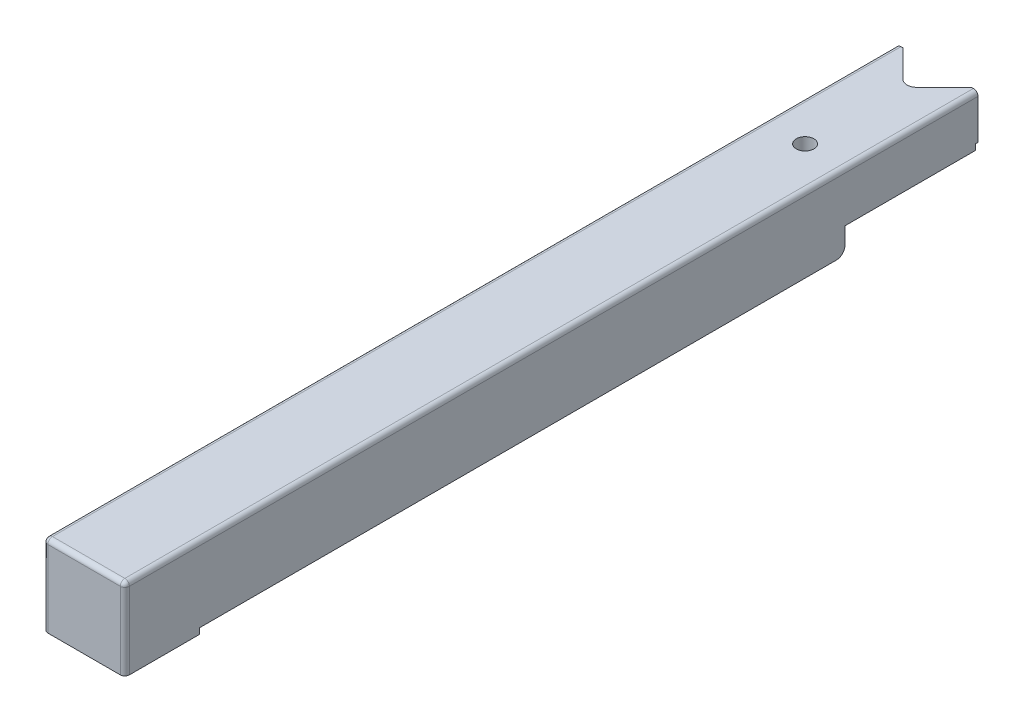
ISO-10303-21;
HEADER;
FILE_DESCRIPTION(('STEP AP214'),'2;1');
FILE_NAME('part.step','',(''),(''),'','','');
FILE_SCHEMA(('AUTOMOTIVE_DESIGN { 1 0 10303 214 1 1 1 1 }'));
ENDSEC;
DATA;
#1=APPLICATION_CONTEXT('core data for automotive mechanical design processes');
#2=APPLICATION_PROTOCOL_DEFINITION('international standard','automotive_design',2000,#1);
#3=PRODUCT_CONTEXT('',#1,'mechanical');
#4=PRODUCT('Part','Part','',(#3));
#5=PRODUCT_RELATED_PRODUCT_CATEGORY('part','',(#4));
#6=PRODUCT_DEFINITION_FORMATION('','',#4);
#7=PRODUCT_DEFINITION_CONTEXT('part definition',#1,'design');
#8=PRODUCT_DEFINITION('design','',#6,#7);
#9=PRODUCT_DEFINITION_SHAPE('','',#8);
#10=(LENGTH_UNIT() NAMED_UNIT(*) SI_UNIT(.MILLI.,.METRE.));
#11=(NAMED_UNIT(*) PLANE_ANGLE_UNIT() SI_UNIT($,.RADIAN.));
#12=(NAMED_UNIT(*) SI_UNIT($,.STERADIAN.) SOLID_ANGLE_UNIT());
#13=UNCERTAINTY_MEASURE_WITH_UNIT(LENGTH_MEASURE(1.E-05),#10,'distance_accuracy_value','');
#14=(GEOMETRIC_REPRESENTATION_CONTEXT(3) GLOBAL_UNCERTAINTY_ASSIGNED_CONTEXT((#13)) GLOBAL_UNIT_ASSIGNED_CONTEXT((#10,
#11,#12)) REPRESENTATION_CONTEXT('',''));
#15=CARTESIAN_POINT('',(0.,0.,0.));
#16=DIRECTION('',(0.,0.,1.));
#17=DIRECTION('',(1.,0.,0.));
#18=AXIS2_PLACEMENT_3D('',#15,#16,#17);
#19=CARTESIAN_POINT('',(22.606,-27.813,-471.678));
#20=DIRECTION('',(0.,1.,0.));
#21=DIRECTION('',(0.,0.,1.));
#22=AXIS2_PLACEMENT_3D('',#19,#20,#21);
#23=PLANE('',#22);
#24=CARTESIAN_POINT('',(0.,-27.813,-399.796));
#25=DIRECTION('',(0.,-1.,0.));
#26=DIRECTION('',(0.,0.,-1.));
#27=AXIS2_PLACEMENT_3D('',#24,#25,#26);
#28=CIRCLE('',#27,4.88949999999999);
#29=CARTESIAN_POINT('',(0.,-27.813,-404.6855));
#30=VERTEX_POINT('',#29);
#31=EDGE_CURVE('E369',#30,#30,#28,.T.);
#32=ORIENTED_EDGE('',*,*,#31,.F.);
#33=EDGE_LOOP('',(#32));
#34=FACE_BOUND('',#33,.T.);
#35=DIRECTION('',(0.707106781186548,0.,-0.707106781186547));
#36=VECTOR('',#35,1.);
#37=CARTESIAN_POINT('',(20.5739999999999,-27.813,-471.678));
#38=LINE('',#37,#36);
#39=CARTESIAN_POINT('',(3.95131269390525,-27.813,-455.055312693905));
#40=VERTEX_POINT('',#39);
#41=CARTESIAN_POINT('',(20.5739999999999,-27.813,-471.678));
#42=VERTEX_POINT('',#41);
#43=EDGE_CURVE('E318',#40,#42,#38,.T.);
#44=ORIENTED_EDGE('',*,*,#43,.T.);
#45=DIRECTION('',(-1.,0.,0.));
#46=VECTOR('',#45,1.);
#47=CARTESIAN_POINT('',(22.606,-27.813,-471.678));
#48=LINE('',#47,#46);
#49=CARTESIAN_POINT('',(22.606,-27.813,-471.678));
#50=VERTEX_POINT('',#49);
#51=EDGE_CURVE('E505',#50,#42,#48,.T.);
#52=ORIENTED_EDGE('',*,*,#51,.F.);
#53=DIRECTION('',(0.,0.,-1.));
#54=VECTOR('',#53,1.);
#55=CARTESIAN_POINT('',(22.606,-27.813,-471.678));
#56=LINE('',#55,#54);
#57=CARTESIAN_POINT('',(22.606,-27.813,-399.31338176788));
#58=VERTEX_POINT('',#57);
#59=EDGE_CURVE('E441',#58,#50,#56,.T.);
#60=ORIENTED_EDGE('',*,*,#59,.F.);
#61=DIRECTION('',(-1.,0.,0.));
#62=VECTOR('',#61,1.);
#63=CARTESIAN_POINT('',(22.606,-27.813,-399.31338176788));
#64=LINE('',#63,#62);
#65=CARTESIAN_POINT('',(17.8308,-27.813,-399.31338176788));
#66=VERTEX_POINT('',#65);
#67=EDGE_CURVE('E509',#58,#66,#64,.T.);
#68=ORIENTED_EDGE('',*,*,#67,.T.);
#69=DIRECTION('',(1.,0.,0.));
#70=VECTOR('',#69,1.);
#71=CARTESIAN_POINT('',(-22.606,-27.813,-399.31338176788));
#72=LINE('',#71,#70);
#73=CARTESIAN_POINT('',(8.05004595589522,-27.813,-399.31338176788));
#74=VERTEX_POINT('',#73);
#75=EDGE_CURVE('E385',#74,#66,#72,.T.);
#76=ORIENTED_EDGE('',*,*,#75,.F.);
#77=CARTESIAN_POINT('',(0.,-27.813,-399.796));
#78=DIRECTION('',(0.,1.,0.));
#79=DIRECTION('',(0.,0.,1.));
#80=AXIS2_PLACEMENT_3D('',#77,#78,#79);
#81=CIRCLE('',#80,8.06449999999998);
#82=CARTESIAN_POINT('',(-8.05004595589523,-27.813,-399.31338176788));
#83=VERTEX_POINT('',#82);
#84=EDGE_CURVE('E374',#74,#83,#81,.F.);
#85=ORIENTED_EDGE('',*,*,#84,.T.);
#86=CARTESIAN_POINT('',(-17.8308,-27.813,-399.31338176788));
#87=VERTEX_POINT('',#86);
#88=EDGE_CURVE('E389',#87,#83,#72,.T.);
#89=ORIENTED_EDGE('',*,*,#88,.F.);
#90=CARTESIAN_POINT('',(-22.606,-27.813,-399.31338176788));
#91=VERTEX_POINT('',#90);
#92=EDGE_CURVE('E508',#87,#91,#64,.T.);
#93=ORIENTED_EDGE('',*,*,#92,.T.);
#94=DIRECTION('',(0.,0.,-1.));
#95=VECTOR('',#94,1.);
#96=CARTESIAN_POINT('',(-22.606,-27.813,-471.678));
#97=LINE('',#96,#95);
#98=CARTESIAN_POINT('',(-22.606,-27.813,-471.678));
#99=VERTEX_POINT('',#98);
#100=EDGE_CURVE('E462',#91,#99,#97,.T.);
#101=ORIENTED_EDGE('',*,*,#100,.T.);
#102=CARTESIAN_POINT('',(-20.5739999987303,-27.813,-471.678));
#103=VERTEX_POINT('',#102);
#104=EDGE_CURVE('E504',#103,#99,#48,.T.);
#105=ORIENTED_EDGE('',*,*,#104,.F.);
#106=DIRECTION('',(0.707106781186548,0.,0.707106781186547));
#107=VECTOR('',#106,1.);
#108=CARTESIAN_POINT('',(-3.9513126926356,-27.813,-455.055312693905));
#109=LINE('',#108,#107);
#110=CARTESIAN_POINT('',(-3.9513126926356,-27.813,-455.055312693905));
#111=VERTEX_POINT('',#110);
#112=EDGE_CURVE('E56',#103,#111,#109,.T.);
#113=ORIENTED_EDGE('',*,*,#112,.T.);
#114=CARTESIAN_POINT('',(6.34825525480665E-10,-27.813,-459.006625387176));
#115=DIRECTION('',(0.,1.,0.));
#116=DIRECTION('',(0.,0.,1.));
#117=AXIS2_PLACEMENT_3D('',#114,#115,#116);
#118=CIRCLE('',#117,5.588);
#119=EDGE_CURVE('E51',#111,#40,#118,.T.);
#120=ORIENTED_EDGE('',*,*,#119,.T.);
#121=EDGE_LOOP('',(#44,#52,#60,#68,#76,#85,#89,#93,#101,#105,#113,#120));
#122=FACE_BOUND('',#121,.T.);
#123=ADVANCED_FACE('F34',(#34,#122),#23,.F.);
#124=CARTESIAN_POINT('',(22.606,-27.813,-471.678));
#125=DIRECTION('',(0.,0.,1.));
#126=DIRECTION('',(1.,0.,0.));
#127=AXIS2_PLACEMENT_3D('',#124,#125,#126);
#128=PLANE('',#127);
#129=DIRECTION('',(0.,1.,0.));
#130=VECTOR('',#129,1.);
#131=CARTESIAN_POINT('',(-20.5739999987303,-628.875110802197,-471.678));
#132=LINE('',#131,#130);
#133=CARTESIAN_POINT('',(-20.5739999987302,-24.638,-471.678));
#134=VERTEX_POINT('',#133);
#135=EDGE_CURVE('E308',#103,#134,#132,.T.);
#136=ORIENTED_EDGE('',*,*,#135,.F.);
#137=ORIENTED_EDGE('',*,*,#104,.T.);
#138=DIRECTION('',(0.,1.,0.));
#139=VECTOR('',#138,1.);
#140=CARTESIAN_POINT('',(-22.606,-27.813,-471.678));
#141=LINE('',#140,#139);
#142=CARTESIAN_POINT('',(-22.606,-24.638,-471.678));
#143=VERTEX_POINT('',#142);
#144=EDGE_CURVE('E465',#99,#143,#141,.T.);
#145=ORIENTED_EDGE('',*,*,#144,.T.);
#146=DIRECTION('',(-1.,0.,0.));
#147=VECTOR('',#146,1.);
#148=CARTESIAN_POINT('',(22.606,-24.638,-471.678));
#149=LINE('',#148,#147);
#150=EDGE_CURVE('E502',#134,#143,#149,.T.);
#151=ORIENTED_EDGE('',*,*,#150,.F.);
#152=EDGE_LOOP('',(#136,#137,#145,#151));
#153=FACE_BOUND('',#152,.T.);
#154=ADVANCED_FACE('F693',(#153),#128,.F.);
#155=DIRECTION('',(0.,1.,0.));
#156=VECTOR('',#155,1.);
#157=CARTESIAN_POINT('',(20.5739999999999,-628.875110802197,-471.678));
#158=LINE('',#157,#156);
#159=CARTESIAN_POINT('',(20.5739999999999,-24.638,-471.678));
#160=VERTEX_POINT('',#159);
#161=EDGE_CURVE('E325',#42,#160,#158,.T.);
#162=ORIENTED_EDGE('',*,*,#161,.T.);
#163=CARTESIAN_POINT('',(22.606,-24.638,-471.678));
#164=VERTEX_POINT('',#163);
#165=EDGE_CURVE('E299',#164,#160,#149,.T.);
#166=ORIENTED_EDGE('',*,*,#165,.F.);
#167=DIRECTION('',(0.,1.,0.));
#168=VECTOR('',#167,1.);
#169=CARTESIAN_POINT('',(22.606,-27.813,-471.678));
#170=LINE('',#169,#168);
#171=EDGE_CURVE('E443',#50,#164,#170,.T.);
#172=ORIENTED_EDGE('',*,*,#171,.F.);
#173=ORIENTED_EDGE('',*,*,#51,.T.);
#174=EDGE_LOOP('',(#162,#166,#172,#173));
#175=FACE_BOUND('',#174,.T.);
#176=ADVANCED_FACE('F699',(#175),#128,.F.);
#177=CARTESIAN_POINT('',(-22.606,-24.638,-471.678));
#178=DIRECTION('',(0.,1.,0.));
#179=DIRECTION('',(0.,0.,1.));
#180=AXIS2_PLACEMENT_3D('',#177,#178,#179);
#181=PLANE('',#180);
#182=CARTESIAN_POINT('',(6.34825525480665E-10,-24.638,-459.006625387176));
#183=DIRECTION('',(0.,1.,0.));
#184=DIRECTION('',(0.,0.,1.));
#185=AXIS2_PLACEMENT_3D('',#182,#183,#184);
#186=CIRCLE('',#185,5.588);
#187=CARTESIAN_POINT('',(-3.9513126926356,-24.638,-455.055312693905));
#188=VERTEX_POINT('',#187);
#189=CARTESIAN_POINT('',(3.95131269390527,-24.638,-455.055312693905));
#190=VERTEX_POINT('',#189);
#191=EDGE_CURVE('E302',#188,#190,#186,.T.);
#192=ORIENTED_EDGE('',*,*,#191,.F.);
#193=DIRECTION('',(0.707106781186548,0.,0.707106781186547));
#194=VECTOR('',#193,1.);
#195=CARTESIAN_POINT('',(-3.9513126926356,-24.638,-455.055312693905));
#196=LINE('',#195,#194);
#197=CARTESIAN_POINT('',(-17.8308,-24.638,-468.93480000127));
#198=VERTEX_POINT('',#197);
#199=EDGE_CURVE('E316',#198,#188,#196,.T.);
#200=ORIENTED_EDGE('',*,*,#199,.F.);
#201=DIRECTION('',(0.,0.,1.));
#202=VECTOR('',#201,1.);
#203=CARTESIAN_POINT('',(-17.8308,-24.638,-394.53818176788));
#204=LINE('',#203,#202);
#205=CARTESIAN_POINT('',(-17.8308,-24.638,-399.31338176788));
#206=VERTEX_POINT('',#205);
#207=EDGE_CURVE('E552',#198,#206,#204,.T.);
#208=ORIENTED_EDGE('',*,*,#207,.T.);
#209=DIRECTION('',(1.,0.,0.));
#210=VECTOR('',#209,1.);
#211=CARTESIAN_POINT('',(-22.606,-24.638,-399.31338176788));
#212=LINE('',#211,#210);
#213=CARTESIAN_POINT('',(-8.05004595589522,-24.638,-399.31338176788));
#214=VERTEX_POINT('',#213);
#215=EDGE_CURVE('E291',#206,#214,#212,.T.);
#216=ORIENTED_EDGE('',*,*,#215,.T.);
#217=CARTESIAN_POINT('',(0.,-24.638,-399.796));
#218=DIRECTION('',(0.,1.,0.));
#219=DIRECTION('',(0.,0.,1.));
#220=AXIS2_PLACEMENT_3D('',#217,#218,#219);
#221=CIRCLE('',#220,8.06449999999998);
#222=CARTESIAN_POINT('',(8.05004595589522,-24.638,-399.31338176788));
#223=VERTEX_POINT('',#222);
#224=EDGE_CURVE('E38',#223,#214,#221,.T.);
#225=ORIENTED_EDGE('',*,*,#224,.F.);
#226=CARTESIAN_POINT('',(17.8308,-24.638,-399.31338176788));
#227=VERTEX_POINT('',#226);
#228=EDGE_CURVE('E288',#223,#227,#212,.T.);
#229=ORIENTED_EDGE('',*,*,#228,.T.);
#230=DIRECTION('',(0.,0.,1.));
#231=VECTOR('',#230,1.);
#232=CARTESIAN_POINT('',(17.8308,-24.638,-394.53818176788));
#233=LINE('',#232,#231);
#234=CARTESIAN_POINT('',(17.8308,-24.638,-468.9348));
#235=VERTEX_POINT('',#234);
#236=EDGE_CURVE('E272',#235,#227,#233,.T.);
#237=ORIENTED_EDGE('',*,*,#236,.F.);
#238=DIRECTION('',(0.707106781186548,0.,-0.707106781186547));
#239=VECTOR('',#238,1.);
#240=CARTESIAN_POINT('',(20.5739999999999,-24.638,-471.678));
#241=LINE('',#240,#239);
#242=EDGE_CURVE('E285',#190,#235,#241,.T.);
#243=ORIENTED_EDGE('',*,*,#242,.F.);
#244=EDGE_LOOP('',(#192,#200,#208,#216,#225,#229,#237,#243));
#245=FACE_BOUND('',#244,.T.);
#246=ADVANCED_FACE('F283',(#245),#181,.T.);
#247=CARTESIAN_POINT('',(22.606,-24.638,-471.678));
#248=DIRECTION('',(0.,1.,0.));
#249=DIRECTION('',(0.,0.,1.));
#250=AXIS2_PLACEMENT_3D('',#247,#248,#249);
#251=PLANE('',#250);
#252=DIRECTION('',(-0.707106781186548,0.,-0.707106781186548));
#253=VECTOR('',#252,1.);
#254=CARTESIAN_POINT('',(2.47650000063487,-24.638,-451.548500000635));
#255=LINE('',#254,#253);
#256=CARTESIAN_POINT('',(-17.8308,-24.638,-471.85580000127));
#257=VERTEX_POINT('',#256);
#258=CARTESIAN_POINT('',(-19.0499999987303,-24.638,-473.075));
#259=VERTEX_POINT('',#258);
#260=EDGE_CURVE('E357',#257,#259,#255,.T.);
#261=ORIENTED_EDGE('',*,*,#260,.F.);
#262=DIRECTION('',(0.,0.,-1.));
#263=VECTOR('',#262,1.);
#264=CARTESIAN_POINT('',(-17.8308,-24.638,-471.678));
#265=LINE('',#264,#263);
#266=EDGE_CURVE('E409',#198,#257,#265,.T.);
#267=ORIENTED_EDGE('',*,*,#266,.F.);
#268=EDGE_CURVE('E313',#134,#198,#196,.T.);
#269=ORIENTED_EDGE('',*,*,#268,.F.);
#270=ORIENTED_EDGE('',*,*,#150,.T.);
#271=DIRECTION('',(0.,0.,-1.));
#272=VECTOR('',#271,1.);
#273=CARTESIAN_POINT('',(-22.606,-24.638,-471.678));
#274=LINE('',#273,#272);
#275=CARTESIAN_POINT('',(-22.606,-24.638,-473.075));
#276=VERTEX_POINT('',#275);
#277=EDGE_CURVE('E468',#143,#276,#274,.T.);
#278=ORIENTED_EDGE('',*,*,#277,.T.);
#279=DIRECTION('',(-1.,0.,0.));
#280=VECTOR('',#279,1.);
#281=CARTESIAN_POINT('',(22.606,-24.638,-473.075));
#282=LINE('',#281,#280);
#283=EDGE_CURVE('E498',#259,#276,#282,.T.);
#284=ORIENTED_EDGE('',*,*,#283,.F.);
#285=EDGE_LOOP('',(#261,#267,#269,#270,#278,#284));
#286=FACE_BOUND('',#285,.T.);
#287=ADVANCED_FACE('F755',(#286),#251,.F.);
#288=CARTESIAN_POINT('',(22.606,-24.638,-473.075));
#289=DIRECTION('',(0.,0.,1.));
#290=DIRECTION('',(1.,0.,0.));
#291=AXIS2_PLACEMENT_3D('',#288,#289,#290);
#292=PLANE('',#291);
#293=DIRECTION('',(0.,-1.,0.));
#294=VECTOR('',#293,1.);
#295=CARTESIAN_POINT('',(-19.0499999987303,631.859610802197,-473.075));
#296=LINE('',#295,#294);
#297=CARTESIAN_POINT('',(-19.0499999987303,0.,-473.075));
#298=VERTEX_POINT('',#297);
#299=EDGE_CURVE('E335',#298,#259,#296,.T.);
#300=ORIENTED_EDGE('',*,*,#299,.T.);
#301=ORIENTED_EDGE('',*,*,#283,.T.);
#302=DIRECTION('',(0.,1.,0.));
#303=VECTOR('',#302,1.);
#304=CARTESIAN_POINT('',(-22.606,-24.638,-473.075));
#305=LINE('',#304,#303);
#306=CARTESIAN_POINT('',(-22.606,-2.54,-473.075));
#307=VERTEX_POINT('',#306);
#308=EDGE_CURVE('E471',#276,#307,#305,.T.);
#309=ORIENTED_EDGE('',*,*,#308,.T.);
#310=CARTESIAN_POINT('',(-20.066,-2.54,-473.075));
#311=DIRECTION('',(0.,0.,1.));
#312=DIRECTION('',(1.,0.,0.));
#313=AXIS2_PLACEMENT_3D('',#310,#311,#312);
#314=CIRCLE('',#313,2.54);
#315=CARTESIAN_POINT('',(-20.066,0.,-473.075));
#316=VERTEX_POINT('',#315);
#317=EDGE_CURVE('E549',#307,#316,#314,.F.);
#318=ORIENTED_EDGE('',*,*,#317,.T.);
#319=DIRECTION('',(-1.,0.,0.));
#320=VECTOR('',#319,1.);
#321=CARTESIAN_POINT('',(22.606,0.,-473.075));
#322=LINE('',#321,#320);
#323=EDGE_CURVE('E494',#298,#316,#322,.T.);
#324=ORIENTED_EDGE('',*,*,#323,.F.);
#325=EDGE_LOOP('',(#300,#301,#309,#318,#324));
#326=FACE_BOUND('',#325,.T.);
#327=ADVANCED_FACE('F734',(#326),#292,.F.);
#328=DIRECTION('',(0.,-1.,0.));
#329=VECTOR('',#328,1.);
#330=CARTESIAN_POINT('',(19.0499999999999,631.859610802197,-473.075));
#331=LINE('',#330,#329);
#332=CARTESIAN_POINT('',(19.0499999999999,0.,-473.075));
#333=VERTEX_POINT('',#332);
#334=CARTESIAN_POINT('',(19.0499999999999,-24.638,-473.075));
#335=VERTEX_POINT('',#334);
#336=EDGE_CURVE('E328',#333,#335,#331,.T.);
#337=ORIENTED_EDGE('',*,*,#336,.F.);
#338=CARTESIAN_POINT('',(20.066,0.,-473.075));
#339=VERTEX_POINT('',#338);
#340=EDGE_CURVE('E495',#339,#333,#322,.T.);
#341=ORIENTED_EDGE('',*,*,#340,.F.);
#342=CARTESIAN_POINT('',(20.066,-2.54,-473.075));
#343=DIRECTION('',(0.,0.,1.));
#344=DIRECTION('',(1.,0.,0.));
#345=AXIS2_PLACEMENT_3D('',#342,#343,#344);
#346=CIRCLE('',#345,2.54);
#347=CARTESIAN_POINT('',(22.606,-2.54,-473.075));
#348=VERTEX_POINT('',#347);
#349=EDGE_CURVE('E547',#339,#348,#346,.F.);
#350=ORIENTED_EDGE('',*,*,#349,.T.);
#351=DIRECTION('',(0.,1.,0.));
#352=VECTOR('',#351,1.);
#353=CARTESIAN_POINT('',(22.606,-24.638,-473.075));
#354=LINE('',#353,#352);
#355=CARTESIAN_POINT('',(22.606,-24.638,-473.075));
#356=VERTEX_POINT('',#355);
#357=EDGE_CURVE('E447',#356,#348,#354,.T.);
#358=ORIENTED_EDGE('',*,*,#357,.F.);
#359=EDGE_CURVE('E499',#356,#335,#282,.T.);
#360=ORIENTED_EDGE('',*,*,#359,.T.);
#361=EDGE_LOOP('',(#337,#341,#350,#358,#360));
#362=FACE_BOUND('',#361,.T.);
#363=ADVANCED_FACE('F633',(#362),#292,.F.);
#364=DIRECTION('',(-0.707106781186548,0.,0.707106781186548));
#365=VECTOR('',#364,1.);
#366=CARTESIAN_POINT('',(20.1295,-24.638,-474.1545));
#367=LINE('',#366,#365);
#368=CARTESIAN_POINT('',(17.8308,-24.638,-471.8558));
#369=VERTEX_POINT('',#368);
#370=EDGE_CURVE('E342',#335,#369,#367,.T.);
#371=ORIENTED_EDGE('',*,*,#370,.F.);
#372=ORIENTED_EDGE('',*,*,#359,.F.);
#373=DIRECTION('',(0.,0.,-1.));
#374=VECTOR('',#373,1.);
#375=CARTESIAN_POINT('',(22.606,-24.638,-471.678));
#376=LINE('',#375,#374);
#377=EDGE_CURVE('E445',#164,#356,#376,.T.);
#378=ORIENTED_EDGE('',*,*,#377,.F.);
#379=ORIENTED_EDGE('',*,*,#165,.T.);
#380=EDGE_CURVE('E295',#235,#160,#241,.T.);
#381=ORIENTED_EDGE('',*,*,#380,.F.);
#382=DIRECTION('',(0.,0.,-1.));
#383=VECTOR('',#382,1.);
#384=CARTESIAN_POINT('',(17.8308,-24.638,-471.678));
#385=LINE('',#384,#383);
#386=EDGE_CURVE('E268',#235,#369,#385,.T.);
#387=ORIENTED_EDGE('',*,*,#386,.T.);
#388=EDGE_LOOP('',(#371,#372,#378,#379,#381,#387));
#389=FACE_BOUND('',#388,.T.);
#390=ADVANCED_FACE('F296',(#389),#251,.F.);
#391=CARTESIAN_POINT('',(22.606,0.,-473.075));
#392=DIRECTION('',(0.,-1.,0.));
#393=DIRECTION('',(0.,0.,-1.));
#394=AXIS2_PLACEMENT_3D('',#391,#392,#393);
#395=PLANE('',#394);
#396=CARTESIAN_POINT('',(0.,0.,-399.796));
#397=DIRECTION('',(0.,-1.,0.));
#398=DIRECTION('',(0.,0.,-1.));
#399=AXIS2_PLACEMENT_3D('',#396,#397,#398);
#400=CIRCLE('',#399,4.88949999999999);
#401=CARTESIAN_POINT('',(0.,0.,-404.6855));
#402=VERTEX_POINT('',#401);
#403=EDGE_CURVE('E371',#402,#402,#400,.T.);
#404=ORIENTED_EDGE('',*,*,#403,.T.);
#405=EDGE_LOOP('',(#404));
#406=FACE_BOUND('',#405,.T.);
#407=DIRECTION('',(0.707106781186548,0.,0.707106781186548));
#408=VECTOR('',#407,1.);
#409=CARTESIAN_POINT('',(1.77800000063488,0.,-452.247000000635));
#410=LINE('',#409,#408);
#411=CARTESIAN_POINT('',(-3.9513126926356,0.,-457.976312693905));
#412=VERTEX_POINT('',#411);
#413=EDGE_CURVE('E359',#298,#412,#410,.T.);
#414=ORIENTED_EDGE('',*,*,#413,.F.);
#415=ORIENTED_EDGE('',*,*,#323,.T.);
#416=DIRECTION('',(0.,0.,1.));
#417=VECTOR('',#416,1.);
#418=CARTESIAN_POINT('',(-20.066,0.,-473.075));
#419=LINE('',#418,#417);
#420=CARTESIAN_POINT('',(-20.066,0.,-2.54));
#421=VERTEX_POINT('',#420);
#422=EDGE_CURVE('E545',#316,#421,#419,.T.);
#423=ORIENTED_EDGE('',*,*,#422,.T.);
#424=DIRECTION('',(-1.,0.,0.));
#425=VECTOR('',#424,1.);
#426=CARTESIAN_POINT('',(22.606,0.,-2.53999999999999));
#427=LINE('',#426,#425);
#428=CARTESIAN_POINT('',(20.066,0.,-2.54));
#429=VERTEX_POINT('',#428);
#430=EDGE_CURVE('E543',#421,#429,#427,.F.);
#431=ORIENTED_EDGE('',*,*,#430,.T.);
#432=DIRECTION('',(0.,0.,1.));
#433=VECTOR('',#432,1.);
#434=CARTESIAN_POINT('',(20.066,0.,-473.075));
#435=LINE('',#434,#433);
#436=EDGE_CURVE('E541',#429,#339,#435,.F.);
#437=ORIENTED_EDGE('',*,*,#436,.T.);
#438=ORIENTED_EDGE('',*,*,#340,.T.);
#439=DIRECTION('',(0.707106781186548,0.,-0.707106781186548));
#440=VECTOR('',#439,1.);
#441=CARTESIAN_POINT('',(20.8279999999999,0.,-474.853));
#442=LINE('',#441,#440);
#443=CARTESIAN_POINT('',(3.95131269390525,0.,-457.976312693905));
#444=VERTEX_POINT('',#443);
#445=EDGE_CURVE('E344',#444,#333,#442,.T.);
#446=ORIENTED_EDGE('',*,*,#445,.F.);
#447=CARTESIAN_POINT('',(6.34825525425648E-10,0.,-461.927625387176));
#448=DIRECTION('',(0.,-1.,0.));
#449=DIRECTION('',(0.,0.,-1.));
#450=AXIS2_PLACEMENT_3D('',#447,#448,#449);
#451=CIRCLE('',#450,5.588);
#452=EDGE_CURVE('E349',#412,#444,#451,.F.);
#453=ORIENTED_EDGE('',*,*,#452,.F.);
#454=EDGE_LOOP('',(#414,#415,#423,#431,#437,#438,#446,#453));
#455=FACE_BOUND('',#454,.T.);
#456=ADVANCED_FACE('F628',(#406,#455),#395,.F.);
#457=CARTESIAN_POINT('',(22.606,-4.7752,-473.075));
#458=DIRECTION('',(0.,-1.,0.));
#459=DIRECTION('',(0.,0.,-1.));
#460=AXIS2_PLACEMENT_3D('',#457,#458,#459);
#461=PLANE('',#460);
#462=CARTESIAN_POINT('',(0.,-4.7752,-399.796));
#463=DIRECTION('',(0.,-1.,0.));
#464=DIRECTION('',(0.,0.,-1.));
#465=AXIS2_PLACEMENT_3D('',#462,#463,#464);
#466=CIRCLE('',#465,8.06449999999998);
#467=CARTESIAN_POINT('',(0.,-4.7752,-407.8605));
#468=VERTEX_POINT('',#467);
#469=EDGE_CURVE('E43',#468,#468,#466,.T.);
#470=ORIENTED_EDGE('',*,*,#469,.F.);
#471=EDGE_LOOP('',(#470));
#472=FACE_BOUND('',#471,.T.);
#473=DIRECTION('',(0.,0.,1.));
#474=VECTOR('',#473,1.);
#475=CARTESIAN_POINT('',(-17.8308,-4.7752,-473.075));
#476=LINE('',#475,#474);
#477=CARTESIAN_POINT('',(-17.8308,-4.7752,-471.85580000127));
#478=VERTEX_POINT('',#477);
#479=CARTESIAN_POINT('',(-17.8308,-4.7752,-4.7752));
#480=VERTEX_POINT('',#479);
#481=EDGE_CURVE('E406',#478,#480,#476,.T.);
#482=ORIENTED_EDGE('',*,*,#481,.F.);
#483=DIRECTION('',(0.707106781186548,0.,0.707106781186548));
#484=VECTOR('',#483,1.);
#485=CARTESIAN_POINT('',(1.77800000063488,-4.7752,-452.247000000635));
#486=LINE('',#485,#484);
#487=CARTESIAN_POINT('',(-3.9513126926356,-4.77519999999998,-457.976312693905));
#488=VERTEX_POINT('',#487);
#489=EDGE_CURVE('E354',#478,#488,#486,.T.);
#490=ORIENTED_EDGE('',*,*,#489,.T.);
#491=CARTESIAN_POINT('',(6.34825525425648E-10,-4.77519999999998,-461.927625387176));
#492=DIRECTION('',(0.,-1.,0.));
#493=DIRECTION('',(0.,0.,-1.));
#494=AXIS2_PLACEMENT_3D('',#491,#492,#493);
#495=CIRCLE('',#494,5.588);
#496=CARTESIAN_POINT('',(3.95131269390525,-4.77519999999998,-457.976312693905));
#497=VERTEX_POINT('',#496);
#498=EDGE_CURVE('E346',#488,#497,#495,.F.);
#499=ORIENTED_EDGE('',*,*,#498,.T.);
#500=DIRECTION('',(0.707106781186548,0.,-0.707106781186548));
#501=VECTOR('',#500,1.);
#502=CARTESIAN_POINT('',(20.8279999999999,-4.7752,-474.853));
#503=LINE('',#502,#501);
#504=CARTESIAN_POINT('',(17.8308,-4.7752,-471.8558));
#505=VERTEX_POINT('',#504);
#506=EDGE_CURVE('E339',#497,#505,#503,.T.);
#507=ORIENTED_EDGE('',*,*,#506,.T.);
#508=DIRECTION('',(0.,0.,1.));
#509=VECTOR('',#508,1.);
#510=CARTESIAN_POINT('',(17.8308,-4.7752,-473.075));
#511=LINE('',#510,#509);
#512=CARTESIAN_POINT('',(17.8308,-4.7752,-4.7752));
#513=VERTEX_POINT('',#512);
#514=EDGE_CURVE('E279',#505,#513,#511,.T.);
#515=ORIENTED_EDGE('',*,*,#514,.T.);
#516=DIRECTION('',(-1.,0.,0.));
#517=VECTOR('',#516,1.);
#518=CARTESIAN_POINT('',(22.606,-4.7752,-4.7752));
#519=LINE('',#518,#517);
#520=EDGE_CURVE('E410',#513,#480,#519,.T.);
#521=ORIENTED_EDGE('',*,*,#520,.T.);
#522=EDGE_LOOP('',(#482,#490,#499,#507,#515,#521));
#523=FACE_BOUND('',#522,.T.);
#524=ADVANCED_FACE('F617',(#472,#523),#461,.T.);
#525=CARTESIAN_POINT('',(17.8308,-37.1348,-394.53818176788));
#526=DIRECTION('',(1.,0.,0.));
#527=DIRECTION('',(0.,0.,-1.));
#528=AXIS2_PLACEMENT_3D('',#525,#526,#527);
#529=PLANE('',#528);
#530=DIRECTION('',(0.,1.,0.));
#531=VECTOR('',#530,1.);
#532=CARTESIAN_POINT('',(17.8308,-37.1348,-471.8558));
#533=LINE('',#532,#531);
#534=EDGE_CURVE('E275',#369,#505,#533,.T.);
#535=ORIENTED_EDGE('',*,*,#534,.F.);
#536=ORIENTED_EDGE('',*,*,#386,.F.);
#537=ORIENTED_EDGE('',*,*,#236,.T.);
#538=DIRECTION('',(0.,-1.,0.));
#539=VECTOR('',#538,1.);
#540=CARTESIAN_POINT('',(17.8308,-37.1348,-399.31338176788));
#541=LINE('',#540,#539);
#542=EDGE_CURVE('E290',#227,#66,#541,.T.);
#543=ORIENTED_EDGE('',*,*,#542,.T.);
#544=DIRECTION('',(0.,1.,0.));
#545=VECTOR('',#544,1.);
#546=CARTESIAN_POINT('',(17.8308,-37.1348,-399.31338176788));
#547=LINE('',#546,#545);
#548=CARTESIAN_POINT('',(17.8308,-37.1348,-399.31338176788));
#549=VERTEX_POINT('',#548);
#550=EDGE_CURVE('E280',#549,#66,#547,.T.);
#551=ORIENTED_EDGE('',*,*,#550,.F.);
#552=CARTESIAN_POINT('',(17.8308,-37.1348,-394.53818176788));
#553=DIRECTION('',(1.,0.,0.));
#554=DIRECTION('',(0.,0.,-1.));
#555=AXIS2_PLACEMENT_3D('',#552,#553,#554);
#556=CIRCLE('',#555,4.77519999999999);
#557=CARTESIAN_POINT('',(17.8308,-41.91,-394.53818176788));
#558=VERTEX_POINT('',#557);
#559=EDGE_CURVE('E424',#558,#549,#556,.T.);
#560=ORIENTED_EDGE('',*,*,#559,.F.);
#561=DIRECTION('',(0.,0.,-1.));
#562=VECTOR('',#561,1.);
#563=CARTESIAN_POINT('',(17.8308,-41.91,-394.53818176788));
#564=LINE('',#563,#562);
#565=CARTESIAN_POINT('',(17.8308,-41.91,-41.275));
#566=VERTEX_POINT('',#565);
#567=EDGE_CURVE('E414',#566,#558,#564,.T.);
#568=ORIENTED_EDGE('',*,*,#567,.F.);
#569=DIRECTION('',(0.,-1.,0.));
#570=VECTOR('',#569,1.);
#571=CARTESIAN_POINT('',(17.8308,-37.1348,-41.2749999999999));
#572=LINE('',#571,#570);
#573=CARTESIAN_POINT('',(17.8308,-41.783,-41.2749999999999));
#574=VERTEX_POINT('',#573);
#575=EDGE_CURVE('E396',#574,#566,#572,.T.);
#576=ORIENTED_EDGE('',*,*,#575,.F.);
#577=DIRECTION('',(0.,0.,1.));
#578=VECTOR('',#577,1.);
#579=CARTESIAN_POINT('',(17.8308,-41.783,-394.53818176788));
#580=LINE('',#579,#578);
#581=CARTESIAN_POINT('',(17.8308,-41.783,-4.7752));
#582=VERTEX_POINT('',#581);
#583=EDGE_CURVE('E403',#574,#582,#580,.T.);
#584=ORIENTED_EDGE('',*,*,#583,.T.);
#585=DIRECTION('',(0.,-1.,0.));
#586=VECTOR('',#585,1.);
#587=CARTESIAN_POINT('',(17.8308,0.,-4.7752));
#588=LINE('',#587,#586);
#589=EDGE_CURVE('E416',#513,#582,#588,.T.);
#590=ORIENTED_EDGE('',*,*,#589,.F.);
#591=ORIENTED_EDGE('',*,*,#514,.F.);
#592=EDGE_LOOP('',(#535,#536,#537,#543,#551,#560,#568,#576,#584,#590,#591));
#593=FACE_BOUND('',#592,.T.);
#594=ADVANCED_FACE('F270',(#593),#529,.F.);
#595=CARTESIAN_POINT('',(-17.8308,-37.1348,-394.53818176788));
#596=DIRECTION('',(1.,0.,0.));
#597=DIRECTION('',(0.,0.,-1.));
#598=AXIS2_PLACEMENT_3D('',#595,#596,#597);
#599=PLANE('',#598);
#600=ORIENTED_EDGE('',*,*,#266,.T.);
#601=DIRECTION('',(0.,1.,0.));
#602=VECTOR('',#601,1.);
#603=CARTESIAN_POINT('',(-17.8308,-37.1348,-471.85580000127));
#604=LINE('',#603,#602);
#605=EDGE_CURVE('E351',#257,#478,#604,.T.);
#606=ORIENTED_EDGE('',*,*,#605,.T.);
#607=ORIENTED_EDGE('',*,*,#481,.T.);
#608=DIRECTION('',(0.,-1.,0.));
#609=VECTOR('',#608,1.);
#610=CARTESIAN_POINT('',(-17.8308,0.,-4.7752));
#611=LINE('',#610,#609);
#612=CARTESIAN_POINT('',(-17.8308,-41.783,-4.7752));
#613=VERTEX_POINT('',#612);
#614=EDGE_CURVE('E408',#480,#613,#611,.T.);
#615=ORIENTED_EDGE('',*,*,#614,.T.);
#616=DIRECTION('',(0.,0.,1.));
#617=VECTOR('',#616,1.);
#618=CARTESIAN_POINT('',(-17.8308,-41.783,-394.53818176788));
#619=LINE('',#618,#617);
#620=CARTESIAN_POINT('',(-17.8308,-41.783,-41.2749999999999));
#621=VERTEX_POINT('',#620);
#622=EDGE_CURVE('E519',#621,#613,#619,.T.);
#623=ORIENTED_EDGE('',*,*,#622,.F.);
#624=DIRECTION('',(0.,-1.,0.));
#625=VECTOR('',#624,1.);
#626=CARTESIAN_POINT('',(-17.8308,-37.1348,-41.2749999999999));
#627=LINE('',#626,#625);
#628=CARTESIAN_POINT('',(-17.8308,-41.91,-41.2749999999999));
#629=VERTEX_POINT('',#628);
#630=EDGE_CURVE('E516',#621,#629,#627,.T.);
#631=ORIENTED_EDGE('',*,*,#630,.T.);
#632=DIRECTION('',(0.,0.,-1.));
#633=VECTOR('',#632,1.);
#634=CARTESIAN_POINT('',(-17.8308,-41.91,-394.53818176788));
#635=LINE('',#634,#633);
#636=CARTESIAN_POINT('',(-17.8308,-41.91,-394.53818176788));
#637=VERTEX_POINT('',#636);
#638=EDGE_CURVE('E419',#629,#637,#635,.T.);
#639=ORIENTED_EDGE('',*,*,#638,.T.);
#640=CARTESIAN_POINT('',(-17.8308,-37.1348,-394.53818176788));
#641=DIRECTION('',(1.,0.,0.));
#642=DIRECTION('',(0.,0.,-1.));
#643=AXIS2_PLACEMENT_3D('',#640,#641,#642);
#644=CIRCLE('',#643,4.77519999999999);
#645=CARTESIAN_POINT('',(-17.8308,-37.1348,-399.31338176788));
#646=VERTEX_POINT('',#645);
#647=EDGE_CURVE('E405',#637,#646,#644,.T.);
#648=ORIENTED_EDGE('',*,*,#647,.T.);
#649=DIRECTION('',(0.,1.,0.));
#650=VECTOR('',#649,1.);
#651=CARTESIAN_POINT('',(-17.8308,-37.1348,-399.31338176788));
#652=LINE('',#651,#650);
#653=EDGE_CURVE('E431',#646,#87,#652,.T.);
#654=ORIENTED_EDGE('',*,*,#653,.T.);
#655=DIRECTION('',(0.,-1.,0.));
#656=VECTOR('',#655,1.);
#657=CARTESIAN_POINT('',(-17.8308,-37.1348,-399.31338176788));
#658=LINE('',#657,#656);
#659=EDGE_CURVE('E569',#206,#87,#658,.T.);
#660=ORIENTED_EDGE('',*,*,#659,.F.);
#661=ORIENTED_EDGE('',*,*,#207,.F.);
#662=EDGE_LOOP('',(#600,#606,#607,#615,#623,#631,#639,#648,#654,#660,#661));
#663=FACE_BOUND('',#662,.T.);
#664=ADVANCED_FACE('F614',(#663),#599,.T.);
#665=CARTESIAN_POINT('',(-22.606,-24.638,-399.31338176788));
#666=DIRECTION('',(0.,0.,1.));
#667=DIRECTION('',(1.,0.,0.));
#668=AXIS2_PLACEMENT_3D('',#665,#666,#667);
#669=PLANE('',#668);
#670=DIRECTION('',(0.,1.,0.));
#671=VECTOR('',#670,1.);
#672=CARTESIAN_POINT('',(8.05004595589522,-50.6228505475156,-399.31338176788));
#673=LINE('',#672,#671);
#674=EDGE_CURVE('E382',#74,#223,#673,.T.);
#675=ORIENTED_EDGE('',*,*,#674,.F.);
#676=ORIENTED_EDGE('',*,*,#75,.T.);
#677=ORIENTED_EDGE('',*,*,#542,.F.);
#678=ORIENTED_EDGE('',*,*,#228,.F.);
#679=EDGE_LOOP('',(#675,#676,#677,#678));
#680=FACE_BOUND('',#679,.T.);
#681=ADVANCED_FACE('F581',(#680),#669,.T.);
#682=CARTESIAN_POINT('',(22.606,-37.1348,-394.53818176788));
#683=DIRECTION('',(-1.,0.,0.));
#684=DIRECTION('',(0.,0.,1.));
#685=AXIS2_PLACEMENT_3D('',#682,#683,#684);
#686=CYLINDRICAL_SURFACE('',#685,4.77519999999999);
#687=ORIENTED_EDGE('',*,*,#647,.F.);
#688=DIRECTION('',(-1.,0.,0.));
#689=VECTOR('',#688,1.);
#690=CARTESIAN_POINT('',(22.606,-41.91,-394.53818176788));
#691=LINE('',#690,#689);
#692=CARTESIAN_POINT('',(-22.606,-41.91,-394.53818176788));
#693=VERTEX_POINT('',#692);
#694=EDGE_CURVE('E456',#637,#693,#691,.T.);
#695=ORIENTED_EDGE('',*,*,#694,.T.);
#696=CARTESIAN_POINT('',(-22.606,-37.1348,-394.53818176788));
#697=DIRECTION('',(1.,0.,0.));
#698=DIRECTION('',(0.,0.,-1.));
#699=AXIS2_PLACEMENT_3D('',#696,#697,#698);
#700=CIRCLE('',#699,4.77519999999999);
#701=CARTESIAN_POINT('',(-22.606,-37.1348,-399.31338176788));
#702=VERTEX_POINT('',#701);
#703=EDGE_CURVE('E413',#693,#702,#700,.T.);
#704=ORIENTED_EDGE('',*,*,#703,.T.);
#705=DIRECTION('',(-1.,0.,0.));
#706=VECTOR('',#705,1.);
#707=CARTESIAN_POINT('',(22.606,-37.1348,-399.31338176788));
#708=LINE('',#707,#706);
#709=EDGE_CURVE('E512',#646,#702,#708,.T.);
#710=ORIENTED_EDGE('',*,*,#709,.F.);
#711=EDGE_LOOP('',(#687,#695,#704,#710));
#712=FACE_BOUND('',#711,.T.);
#713=ADVANCED_FACE('F672',(#712),#686,.T.);
#714=CARTESIAN_POINT('',(22.606,-37.1348,-399.31338176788));
#715=DIRECTION('',(0.,0.,1.));
#716=DIRECTION('',(1.,0.,0.));
#717=AXIS2_PLACEMENT_3D('',#714,#715,#716);
#718=PLANE('',#717);
#719=ORIENTED_EDGE('',*,*,#653,.F.);
#720=ORIENTED_EDGE('',*,*,#709,.T.);
#721=DIRECTION('',(0.,1.,0.));
#722=VECTOR('',#721,1.);
#723=CARTESIAN_POINT('',(-22.606,-37.1348,-399.31338176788));
#724=LINE('',#723,#722);
#725=EDGE_CURVE('E459',#702,#91,#724,.T.);
#726=ORIENTED_EDGE('',*,*,#725,.T.);
#727=ORIENTED_EDGE('',*,*,#92,.F.);
#728=EDGE_LOOP('',(#719,#720,#726,#727));
#729=FACE_BOUND('',#728,.T.);
#730=ADVANCED_FACE('F674',(#729),#718,.F.);
#731=CARTESIAN_POINT('',(22.606,-45.085,-41.275));
#732=DIRECTION('',(0.,1.,0.));
#733=DIRECTION('',(0.,0.,1.));
#734=AXIS2_PLACEMENT_3D('',#731,#732,#733);
#735=PLANE('',#734);
#736=CARTESIAN_POINT('',(0.,-45.085,-22.352));
#737=DIRECTION('',(0.,-1.,0.));
#738=DIRECTION('',(0.,0.,-1.));
#739=AXIS2_PLACEMENT_3D('',#736,#737,#738);
#740=CIRCLE('',#739,17.526);
#741=CARTESIAN_POINT('',(0.,-45.085,-39.878));
#742=VERTEX_POINT('',#741);
#743=EDGE_CURVE('E11',#742,#742,#740,.T.);
#744=ORIENTED_EDGE('',*,*,#743,.F.);
#745=EDGE_LOOP('',(#744));
#746=FACE_BOUND('',#745,.T.);
#747=DIRECTION('',(0.,0.,-1.));
#748=VECTOR('',#747,1.);
#749=CARTESIAN_POINT('',(22.606,-45.085,-41.275));
#750=LINE('',#749,#748);
#751=CARTESIAN_POINT('',(22.606,-45.085,-2.53999999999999));
#752=VERTEX_POINT('',#751);
#753=CARTESIAN_POINT('',(22.606,-45.085,-41.275));
#754=VERTEX_POINT('',#753);
#755=EDGE_CURVE('E450',#752,#754,#750,.T.);
#756=ORIENTED_EDGE('',*,*,#755,.F.);
#757=CARTESIAN_POINT('',(20.066,-45.085,-2.53999999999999));
#758=DIRECTION('',(0.,1.,0.));
#759=DIRECTION('',(0.,0.,1.));
#760=AXIS2_PLACEMENT_3D('',#757,#758,#759);
#761=CIRCLE('',#760,2.54);
#762=CARTESIAN_POINT('',(20.066,-45.085,0.));
#763=VERTEX_POINT('',#762);
#764=EDGE_CURVE('E529',#752,#763,#761,.F.);
#765=ORIENTED_EDGE('',*,*,#764,.T.);
#766=DIRECTION('',(-1.,0.,0.));
#767=VECTOR('',#766,1.);
#768=CARTESIAN_POINT('',(22.606,-45.085,0.));
#769=LINE('',#768,#767);
#770=CARTESIAN_POINT('',(-20.066,-45.085,0.));
#771=VERTEX_POINT('',#770);
#772=EDGE_CURVE('E491',#763,#771,#769,.T.);
#773=ORIENTED_EDGE('',*,*,#772,.T.);
#774=CARTESIAN_POINT('',(-20.066,-45.085,-2.54));
#775=DIRECTION('',(0.,1.,0.));
#776=DIRECTION('',(0.,0.,1.));
#777=AXIS2_PLACEMENT_3D('',#774,#775,#776);
#778=CIRCLE('',#777,2.54);
#779=CARTESIAN_POINT('',(-22.606,-45.085,-2.54));
#780=VERTEX_POINT('',#779);
#781=EDGE_CURVE('E527',#771,#780,#778,.F.);
#782=ORIENTED_EDGE('',*,*,#781,.T.);
#783=DIRECTION('',(0.,0.,-1.));
#784=VECTOR('',#783,1.);
#785=CARTESIAN_POINT('',(-22.606,-45.085,-41.275));
#786=LINE('',#785,#784);
#787=CARTESIAN_POINT('',(-22.606,-45.085,-41.275));
#788=VERTEX_POINT('',#787);
#789=EDGE_CURVE('E474',#780,#788,#786,.T.);
#790=ORIENTED_EDGE('',*,*,#789,.T.);
#791=DIRECTION('',(-1.,0.,0.));
#792=VECTOR('',#791,1.);
#793=CARTESIAN_POINT('',(22.606,-45.085,-41.275));
#794=LINE('',#793,#792);
#795=EDGE_CURVE('E488',#754,#788,#794,.T.);
#796=ORIENTED_EDGE('',*,*,#795,.F.);
#797=EDGE_LOOP('',(#756,#765,#773,#782,#790,#796));
#798=FACE_BOUND('',#797,.T.);
#799=ADVANCED_FACE('F653',(#746,#798),#735,.F.);
#800=CARTESIAN_POINT('',(22.606,-41.91,-394.53818176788));
#801=DIRECTION('',(0.,1.,0.));
#802=DIRECTION('',(0.,0.,1.));
#803=AXIS2_PLACEMENT_3D('',#800,#801,#802);
#804=PLANE('',#803);
#805=ORIENTED_EDGE('',*,*,#638,.F.);
#806=DIRECTION('',(-1.,0.,0.));
#807=VECTOR('',#806,1.);
#808=CARTESIAN_POINT('',(22.606,-41.91,-41.275));
#809=LINE('',#808,#807);
#810=CARTESIAN_POINT('',(-22.606,-41.91,-41.275));
#811=VERTEX_POINT('',#810);
#812=EDGE_CURVE('E484',#629,#811,#809,.T.);
#813=ORIENTED_EDGE('',*,*,#812,.T.);
#814=DIRECTION('',(0.,0.,-1.));
#815=VECTOR('',#814,1.);
#816=CARTESIAN_POINT('',(-22.606,-41.91,-394.53818176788));
#817=LINE('',#816,#815);
#818=EDGE_CURVE('E439',#811,#693,#817,.T.);
#819=ORIENTED_EDGE('',*,*,#818,.T.);
#820=ORIENTED_EDGE('',*,*,#694,.F.);
#821=EDGE_LOOP('',(#805,#813,#819,#820));
#822=FACE_BOUND('',#821,.T.);
#823=ADVANCED_FACE('F667',(#822),#804,.F.);
#824=CARTESIAN_POINT('',(22.606,-41.91,-394.53818176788));
#825=VERTEX_POINT('',#824);
#826=EDGE_CURVE('E481',#825,#558,#691,.T.);
#827=ORIENTED_EDGE('',*,*,#826,.T.);
#828=ORIENTED_EDGE('',*,*,#559,.T.);
#829=CARTESIAN_POINT('',(22.606,-37.1348,-399.31338176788));
#830=VERTEX_POINT('',#829);
#831=EDGE_CURVE('E513',#830,#549,#708,.T.);
#832=ORIENTED_EDGE('',*,*,#831,.F.);
#833=CARTESIAN_POINT('',(22.606,-37.1348,-394.53818176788));
#834=DIRECTION('',(1.,0.,0.));
#835=DIRECTION('',(0.,0.,-1.));
#836=AXIS2_PLACEMENT_3D('',#833,#834,#835);
#837=CIRCLE('',#836,4.77519999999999);
#838=EDGE_CURVE('E435',#825,#830,#837,.T.);
#839=ORIENTED_EDGE('',*,*,#838,.F.);
#840=EDGE_LOOP('',(#827,#828,#832,#839));
#841=FACE_BOUND('',#840,.T.);
#842=ADVANCED_FACE('F596',(#841),#686,.T.);
#843=ORIENTED_EDGE('',*,*,#831,.T.);
#844=ORIENTED_EDGE('',*,*,#550,.T.);
#845=ORIENTED_EDGE('',*,*,#67,.F.);
#846=DIRECTION('',(0.,1.,0.));
#847=VECTOR('',#846,1.);
#848=CARTESIAN_POINT('',(22.606,-37.1348,-399.31338176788));
#849=LINE('',#848,#847);
#850=EDGE_CURVE('E438',#830,#58,#849,.T.);
#851=ORIENTED_EDGE('',*,*,#850,.F.);
#852=EDGE_LOOP('',(#843,#844,#845,#851));
#853=FACE_BOUND('',#852,.T.);
#854=ADVANCED_FACE('F585',(#853),#718,.F.);
#855=CARTESIAN_POINT('',(22.606,0.,0.));
#856=DIRECTION('',(0.,0.,-1.));
#857=DIRECTION('',(-1.,0.,0.));
#858=AXIS2_PLACEMENT_3D('',#855,#856,#857);
#859=PLANE('',#858);
#860=ORIENTED_EDGE('',*,*,#772,.F.);
#861=DIRECTION('',(0.,-1.,0.));
#862=VECTOR('',#861,1.);
#863=CARTESIAN_POINT('',(20.066,0.,0.));
#864=LINE('',#863,#862);
#865=CARTESIAN_POINT('',(20.066,-2.54,0.));
#866=VERTEX_POINT('',#865);
#867=EDGE_CURVE('E535',#763,#866,#864,.F.);
#868=ORIENTED_EDGE('',*,*,#867,.T.);
#869=DIRECTION('',(-1.,0.,0.));
#870=VECTOR('',#869,1.);
#871=CARTESIAN_POINT('',(22.606,-2.54,0.));
#872=LINE('',#871,#870);
#873=CARTESIAN_POINT('',(-20.066,-2.54,0.));
#874=VERTEX_POINT('',#873);
#875=EDGE_CURVE('E531',#866,#874,#872,.T.);
#876=ORIENTED_EDGE('',*,*,#875,.T.);
#877=DIRECTION('',(0.,-1.,0.));
#878=VECTOR('',#877,1.);
#879=CARTESIAN_POINT('',(-20.066,0.,0.));
#880=LINE('',#879,#878);
#881=EDGE_CURVE('E533',#874,#771,#880,.T.);
#882=ORIENTED_EDGE('',*,*,#881,.T.);
#883=EDGE_LOOP('',(#860,#868,#876,#882));
#884=FACE_BOUND('',#883,.T.);
#885=ADVANCED_FACE('F707',(#884),#859,.F.);
#886=CARTESIAN_POINT('',(22.606,-45.085,-41.275));
#887=DIRECTION('',(0.,0.,1.));
#888=DIRECTION('',(0.,-1.,0.));
#889=AXIS2_PLACEMENT_3D('',#886,#887,#888);
#890=PLANE('',#889);
#891=ORIENTED_EDGE('',*,*,#795,.T.);
#892=DIRECTION('',(0.,1.,0.));
#893=VECTOR('',#892,1.);
#894=CARTESIAN_POINT('',(-22.606,-45.085,-41.275));
#895=LINE('',#894,#893);
#896=EDGE_CURVE('E476',#788,#811,#895,.T.);
#897=ORIENTED_EDGE('',*,*,#896,.T.);
#898=ORIENTED_EDGE('',*,*,#812,.F.);
#899=ORIENTED_EDGE('',*,*,#630,.F.);
#900=DIRECTION('',(-1.,0.,0.));
#901=VECTOR('',#900,1.);
#902=CARTESIAN_POINT('',(22.606,-41.783,-41.275));
#903=LINE('',#902,#901);
#904=EDGE_CURVE('E393',#574,#621,#903,.T.);
#905=ORIENTED_EDGE('',*,*,#904,.F.);
#906=ORIENTED_EDGE('',*,*,#575,.T.);
#907=CARTESIAN_POINT('',(22.606,-41.91,-41.275));
#908=VERTEX_POINT('',#907);
#909=EDGE_CURVE('E485',#908,#566,#809,.T.);
#910=ORIENTED_EDGE('',*,*,#909,.F.);
#911=DIRECTION('',(0.,1.,0.));
#912=VECTOR('',#911,1.);
#913=CARTESIAN_POINT('',(22.606,-45.085,-41.275));
#914=LINE('',#913,#912);
#915=EDGE_CURVE('E452',#754,#908,#914,.T.);
#916=ORIENTED_EDGE('',*,*,#915,.F.);
#917=EDGE_LOOP('',(#891,#897,#898,#899,#905,#906,#910,#916));
#918=FACE_BOUND('',#917,.T.);
#919=ADVANCED_FACE('F603',(#918),#890,.F.);
#920=ORIENTED_EDGE('',*,*,#909,.T.);
#921=ORIENTED_EDGE('',*,*,#567,.T.);
#922=ORIENTED_EDGE('',*,*,#826,.F.);
#923=DIRECTION('',(0.,0.,-1.));
#924=VECTOR('',#923,1.);
#925=CARTESIAN_POINT('',(22.606,-41.91,-394.53818176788));
#926=LINE('',#925,#924);
#927=EDGE_CURVE('E454',#908,#825,#926,.T.);
#928=ORIENTED_EDGE('',*,*,#927,.F.);
#929=EDGE_LOOP('',(#920,#921,#922,#928));
#930=FACE_BOUND('',#929,.T.);
#931=ADVANCED_FACE('F598',(#930),#804,.F.);
#932=CARTESIAN_POINT('',(22.606,-37.1348,-394.53818176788));
#933=DIRECTION('',(1.,0.,0.));
#934=DIRECTION('',(0.,0.,-1.));
#935=AXIS2_PLACEMENT_3D('',#932,#933,#934);
#936=PLANE('',#935);
#937=ORIENTED_EDGE('',*,*,#850,.T.);
#938=ORIENTED_EDGE('',*,*,#59,.T.);
#939=ORIENTED_EDGE('',*,*,#171,.T.);
#940=ORIENTED_EDGE('',*,*,#377,.T.);
#941=ORIENTED_EDGE('',*,*,#357,.T.);
#942=DIRECTION('',(0.,0.,1.));
#943=VECTOR('',#942,1.);
#944=CARTESIAN_POINT('',(22.606,-2.54,0.));
#945=LINE('',#944,#943);
#946=CARTESIAN_POINT('',(22.606,-2.54,-2.53999999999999));
#947=VERTEX_POINT('',#946);
#948=EDGE_CURVE('E522',#348,#947,#945,.T.);
#949=ORIENTED_EDGE('',*,*,#948,.T.);
#950=DIRECTION('',(0.,-1.,0.));
#951=VECTOR('',#950,1.);
#952=CARTESIAN_POINT('',(22.606,-45.085,-2.53999999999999));
#953=LINE('',#952,#951);
#954=EDGE_CURVE('E524',#947,#752,#953,.T.);
#955=ORIENTED_EDGE('',*,*,#954,.T.);
#956=ORIENTED_EDGE('',*,*,#755,.T.);
#957=ORIENTED_EDGE('',*,*,#915,.T.);
#958=ORIENTED_EDGE('',*,*,#927,.T.);
#959=ORIENTED_EDGE('',*,*,#838,.T.);
#960=EDGE_LOOP('',(#937,#938,#939,#940,#941,#949,#955,#956,#957,#958,#959));
#961=FACE_BOUND('',#960,.T.);
#962=ADVANCED_FACE('F591',(#961),#936,.T.);
#963=CARTESIAN_POINT('',(-22.606,-37.1348,-394.53818176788));
#964=DIRECTION('',(1.,0.,0.));
#965=DIRECTION('',(0.,0.,-1.));
#966=AXIS2_PLACEMENT_3D('',#963,#964,#965);
#967=PLANE('',#966);
#968=ORIENTED_EDGE('',*,*,#100,.F.);
#969=ORIENTED_EDGE('',*,*,#725,.F.);
#970=ORIENTED_EDGE('',*,*,#703,.F.);
#971=ORIENTED_EDGE('',*,*,#818,.F.);
#972=ORIENTED_EDGE('',*,*,#896,.F.);
#973=ORIENTED_EDGE('',*,*,#789,.F.);
#974=DIRECTION('',(0.,-1.,0.));
#975=VECTOR('',#974,1.);
#976=CARTESIAN_POINT('',(-22.606,-37.1348,-2.53999999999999));
#977=LINE('',#976,#975);
#978=CARTESIAN_POINT('',(-22.606,-2.54,-2.54));
#979=VERTEX_POINT('',#978);
#980=EDGE_CURVE('E539',#780,#979,#977,.F.);
#981=ORIENTED_EDGE('',*,*,#980,.T.);
#982=DIRECTION('',(0.,0.,1.));
#983=VECTOR('',#982,1.);
#984=CARTESIAN_POINT('',(-22.606,-2.54,-394.53818176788));
#985=LINE('',#984,#983);
#986=EDGE_CURVE('E537',#979,#307,#985,.F.);
#987=ORIENTED_EDGE('',*,*,#986,.T.);
#988=ORIENTED_EDGE('',*,*,#308,.F.);
#989=ORIENTED_EDGE('',*,*,#277,.F.);
#990=ORIENTED_EDGE('',*,*,#144,.F.);
#991=EDGE_LOOP('',(#968,#969,#970,#971,#972,#973,#981,#987,#988,#989,#990));
#992=FACE_BOUND('',#991,.T.);
#993=ADVANCED_FACE('F660',(#992),#967,.F.);
#994=CARTESIAN_POINT('',(22.606,0.,-4.7752));
#995=DIRECTION('',(0.,0.,-1.));
#996=DIRECTION('',(-1.,0.,0.));
#997=AXIS2_PLACEMENT_3D('',#994,#995,#996);
#998=PLANE('',#997);
#999=DIRECTION('',(1.,0.,0.));
#1000=VECTOR('',#999,1.);
#1001=CARTESIAN_POINT('',(22.606,-41.783,-4.7752));
#1002=LINE('',#1001,#1000);
#1003=EDGE_CURVE('E400',#613,#582,#1002,.T.);
#1004=ORIENTED_EDGE('',*,*,#1003,.F.);
#1005=ORIENTED_EDGE('',*,*,#614,.F.);
#1006=ORIENTED_EDGE('',*,*,#520,.F.);
#1007=ORIENTED_EDGE('',*,*,#589,.T.);
#1008=EDGE_LOOP('',(#1004,#1005,#1006,#1007));
#1009=FACE_BOUND('',#1008,.T.);
#1010=ADVANCED_FACE('F611',(#1009),#998,.T.);
#1011=CARTESIAN_POINT('',(22.606,-41.783,-41.275));
#1012=DIRECTION('',(0.,1.,0.));
#1013=DIRECTION('',(0.,0.,1.));
#1014=AXIS2_PLACEMENT_3D('',#1011,#1012,#1013);
#1015=PLANE('',#1014);
#1016=CARTESIAN_POINT('',(0.,-41.783,-22.352));
#1017=DIRECTION('',(0.,1.,0.));
#1018=DIRECTION('',(0.,0.,1.));
#1019=AXIS2_PLACEMENT_3D('',#1016,#1017,#1018);
#1020=CIRCLE('',#1019,5.35813);
#1021=CARTESIAN_POINT('',(0.,-41.783,-16.99387));
#1022=VERTEX_POINT('',#1021);
#1023=EDGE_CURVE('E364',#1022,#1022,#1020,.T.);
#1024=ORIENTED_EDGE('',*,*,#1023,.F.);
#1025=EDGE_LOOP('',(#1024));
#1026=FACE_BOUND('',#1025,.T.);
#1027=ORIENTED_EDGE('',*,*,#583,.F.);
#1028=ORIENTED_EDGE('',*,*,#904,.T.);
#1029=ORIENTED_EDGE('',*,*,#622,.T.);
#1030=ORIENTED_EDGE('',*,*,#1003,.T.);
#1031=EDGE_LOOP('',(#1027,#1028,#1029,#1030));
#1032=FACE_BOUND('',#1031,.T.);
#1033=ADVANCED_FACE('F608',(#1026,#1032),#1015,.T.);
#1034=CARTESIAN_POINT('',(-20.066,0.,-2.54));
#1035=DIRECTION('',(0.,-1.,0.));
#1036=DIRECTION('',(0.,0.,-1.));
#1037=AXIS2_PLACEMENT_3D('',#1034,#1035,#1036);
#1038=CYLINDRICAL_SURFACE('',#1037,2.54);
#1039=ORIENTED_EDGE('',*,*,#781,.F.);
#1040=ORIENTED_EDGE('',*,*,#881,.F.);
#1041=CARTESIAN_POINT('',(-20.066,-2.54,-2.54));
#1042=DIRECTION('',(0.,1.,0.));
#1043=DIRECTION('',(0.,0.,1.));
#1044=AXIS2_PLACEMENT_3D('',#1041,#1042,#1043);
#1045=CIRCLE('',#1044,2.54);
#1046=EDGE_CURVE('E397',#979,#874,#1045,.T.);
#1047=ORIENTED_EDGE('',*,*,#1046,.F.);
#1048=ORIENTED_EDGE('',*,*,#980,.F.);
#1049=EDGE_LOOP('',(#1039,#1040,#1047,#1048));
#1050=FACE_BOUND('',#1049,.T.);
#1051=ADVANCED_FACE('F36',(#1050),#1038,.T.);
#1052=CARTESIAN_POINT('',(-20.066,-2.54,-473.075));
#1053=DIRECTION('',(0.,0.,1.));
#1054=DIRECTION('',(1.,0.,0.));
#1055=AXIS2_PLACEMENT_3D('',#1052,#1053,#1054);
#1056=CYLINDRICAL_SURFACE('',#1055,2.54);
#1057=ORIENTED_EDGE('',*,*,#317,.F.);
#1058=ORIENTED_EDGE('',*,*,#986,.F.);
#1059=CARTESIAN_POINT('',(-20.066,-2.54,-2.54));
#1060=DIRECTION('',(0.,0.,1.));
#1061=DIRECTION('',(1.,0.,0.));
#1062=AXIS2_PLACEMENT_3D('',#1059,#1060,#1061);
#1063=CIRCLE('',#1062,2.54);
#1064=EDGE_CURVE('E564',#421,#979,#1063,.T.);
#1065=ORIENTED_EDGE('',*,*,#1064,.F.);
#1066=ORIENTED_EDGE('',*,*,#422,.F.);
#1067=EDGE_LOOP('',(#1057,#1058,#1065,#1066));
#1068=FACE_BOUND('',#1067,.T.);
#1069=ADVANCED_FACE('F720',(#1068),#1056,.T.);
#1070=CARTESIAN_POINT('',(-20.066,-2.54,-2.54));
#1071=DIRECTION('',(0.,0.,1.));
#1072=DIRECTION('',(1.,0.,0.));
#1073=AXIS2_PLACEMENT_3D('',#1070,#1071,#1072);
#1074=SPHERICAL_SURFACE('',#1073,2.54);
#1075=ORIENTED_EDGE('',*,*,#1064,.T.);
#1076=ORIENTED_EDGE('',*,*,#1046,.T.);
#1077=CARTESIAN_POINT('',(-20.066,-2.54,-2.54));
#1078=DIRECTION('',(-1.,0.,0.));
#1079=DIRECTION('',(0.,0.,1.));
#1080=AXIS2_PLACEMENT_3D('',#1077,#1078,#1079);
#1081=CIRCLE('',#1080,2.54);
#1082=EDGE_CURVE('E561',#421,#874,#1081,.F.);
#1083=ORIENTED_EDGE('',*,*,#1082,.F.);
#1084=EDGE_LOOP('',(#1075,#1076,#1083));
#1085=FACE_BOUND('',#1084,.T.);
#1086=ADVANCED_FACE('F717',(#1085),#1074,.T.);
#1087=CARTESIAN_POINT('',(22.606,-2.54,-2.54));
#1088=DIRECTION('',(-1.,0.,0.));
#1089=DIRECTION('',(0.,0.,1.));
#1090=AXIS2_PLACEMENT_3D('',#1087,#1088,#1089);
#1091=CYLINDRICAL_SURFACE('',#1090,2.54);
#1092=ORIENTED_EDGE('',*,*,#1082,.T.);
#1093=ORIENTED_EDGE('',*,*,#875,.F.);
#1094=CARTESIAN_POINT('',(20.066,-2.54,-2.54));
#1095=DIRECTION('',(1.,0.,0.));
#1096=DIRECTION('',(0.,0.,-1.));
#1097=AXIS2_PLACEMENT_3D('',#1094,#1095,#1096);
#1098=CIRCLE('',#1097,2.54);
#1099=EDGE_CURVE('E558',#429,#866,#1098,.T.);
#1100=ORIENTED_EDGE('',*,*,#1099,.F.);
#1101=ORIENTED_EDGE('',*,*,#430,.F.);
#1102=EDGE_LOOP('',(#1092,#1093,#1100,#1101));
#1103=FACE_BOUND('',#1102,.T.);
#1104=ADVANCED_FACE('F714',(#1103),#1091,.T.);
#1105=CARTESIAN_POINT('',(20.066,-2.54,-394.53818176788));
#1106=DIRECTION('',(0.,0.,-1.));
#1107=DIRECTION('',(-1.,0.,0.));
#1108=AXIS2_PLACEMENT_3D('',#1105,#1106,#1107);
#1109=CYLINDRICAL_SURFACE('',#1108,2.54);
#1110=ORIENTED_EDGE('',*,*,#349,.F.);
#1111=ORIENTED_EDGE('',*,*,#436,.F.);
#1112=CARTESIAN_POINT('',(20.066,-2.54,-2.53999999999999));
#1113=DIRECTION('',(0.,0.,1.));
#1114=DIRECTION('',(0.,-1.,0.));
#1115=AXIS2_PLACEMENT_3D('',#1112,#1113,#1114);
#1116=CIRCLE('',#1115,2.54);
#1117=EDGE_CURVE('E555',#947,#429,#1116,.T.);
#1118=ORIENTED_EDGE('',*,*,#1117,.F.);
#1119=ORIENTED_EDGE('',*,*,#948,.F.);
#1120=EDGE_LOOP('',(#1110,#1111,#1118,#1119));
#1121=FACE_BOUND('',#1120,.T.);
#1122=ADVANCED_FACE('F640',(#1121),#1109,.T.);
#1123=CARTESIAN_POINT('',(20.066,-2.54,-2.54));
#1124=DIRECTION('',(0.,0.,1.));
#1125=DIRECTION('',(1.,0.,0.));
#1126=AXIS2_PLACEMENT_3D('',#1123,#1124,#1125);
#1127=SPHERICAL_SURFACE('',#1126,2.54);
#1128=ORIENTED_EDGE('',*,*,#1117,.T.);
#1129=ORIENTED_EDGE('',*,*,#1099,.T.);
#1130=CARTESIAN_POINT('',(20.066,-2.54,-2.54));
#1131=DIRECTION('',(0.,1.,0.));
#1132=DIRECTION('',(-1.,0.,0.));
#1133=AXIS2_PLACEMENT_3D('',#1130,#1131,#1132);
#1134=CIRCLE('',#1133,2.54);
#1135=EDGE_CURVE('E392',#947,#866,#1134,.F.);
#1136=ORIENTED_EDGE('',*,*,#1135,.F.);
#1137=EDGE_LOOP('',(#1128,#1129,#1136));
#1138=FACE_BOUND('',#1137,.T.);
#1139=ADVANCED_FACE('F646',(#1138),#1127,.T.);
#1140=CARTESIAN_POINT('',(20.066,-37.1348,-2.53999999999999));
#1141=DIRECTION('',(0.,1.,0.));
#1142=DIRECTION('',(0.,0.,1.));
#1143=AXIS2_PLACEMENT_3D('',#1140,#1141,#1142);
#1144=CYLINDRICAL_SURFACE('',#1143,2.54);
#1145=ORIENTED_EDGE('',*,*,#1135,.T.);
#1146=ORIENTED_EDGE('',*,*,#867,.F.);
#1147=ORIENTED_EDGE('',*,*,#764,.F.);
#1148=ORIENTED_EDGE('',*,*,#954,.F.);
#1149=EDGE_LOOP('',(#1145,#1146,#1147,#1148));
#1150=FACE_BOUND('',#1149,.T.);
#1151=ADVANCED_FACE('F649',(#1150),#1144,.T.);
#1152=DIRECTION('',(0.,1.,0.));
#1153=VECTOR('',#1152,1.);
#1154=CARTESIAN_POINT('',(-8.05004595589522,-50.6228505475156,-399.31338176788));
#1155=LINE('',#1154,#1153);
#1156=EDGE_CURVE('E379',#214,#83,#1155,.F.);
#1157=ORIENTED_EDGE('',*,*,#1156,.F.);
#1158=ORIENTED_EDGE('',*,*,#215,.F.);
#1159=ORIENTED_EDGE('',*,*,#659,.T.);
#1160=ORIENTED_EDGE('',*,*,#88,.T.);
#1161=EDGE_LOOP('',(#1157,#1158,#1159,#1160));
#1162=FACE_BOUND('',#1161,.T.);
#1163=ADVANCED_FACE('F678',(#1162),#669,.T.);
#1164=CARTESIAN_POINT('',(0.,-50.6228505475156,-399.796));
#1165=DIRECTION('',(0.,1.,0.));
#1166=DIRECTION('',(0.,0.,1.));
#1167=AXIS2_PLACEMENT_3D('',#1164,#1165,#1166);
#1168=CYLINDRICAL_SURFACE('',#1167,8.06449999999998);
#1169=ORIENTED_EDGE('',*,*,#469,.T.);
#1170=EDGE_LOOP('',(#1169));
#1171=FACE_BOUND('',#1170,.T.);
#1172=ORIENTED_EDGE('',*,*,#84,.F.);
#1173=ORIENTED_EDGE('',*,*,#674,.T.);
#1174=ORIENTED_EDGE('',*,*,#224,.T.);
#1175=ORIENTED_EDGE('',*,*,#1156,.T.);
#1176=EDGE_LOOP('',(#1172,#1173,#1174,#1175));
#1177=FACE_BOUND('',#1176,.T.);
#1178=ADVANCED_FACE('F578',(#1171,#1177),#1168,.T.);
#1179=CARTESIAN_POINT('',(0.,0.,-399.796));
#1180=DIRECTION('',(0.,-1.,0.));
#1181=DIRECTION('',(0.,0.,-1.));
#1182=AXIS2_PLACEMENT_3D('',#1179,#1180,#1181);
#1183=CYLINDRICAL_SURFACE('',#1182,4.88949999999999);
#1184=ORIENTED_EDGE('',*,*,#403,.F.);
#1185=EDGE_LOOP('',(#1184));
#1186=FACE_BOUND('',#1185,.T.);
#1187=ORIENTED_EDGE('',*,*,#31,.T.);
#1188=EDGE_LOOP('',(#1187));
#1189=FACE_BOUND('',#1188,.T.);
#1190=ADVANCED_FACE('F685',(#1186,#1189),#1183,.F.);
#1191=CARTESIAN_POINT('',(0.,-48.26,-22.352));
#1192=DIRECTION('',(0.,1.,0.));
#1193=DIRECTION('',(0.,0.,1.));
#1194=AXIS2_PLACEMENT_3D('',#1191,#1192,#1193);
#1195=CYLINDRICAL_SURFACE('',#1194,17.526);
#1196=CARTESIAN_POINT('',(0.,-48.26,-22.352));
#1197=DIRECTION('',(0.,-1.,0.));
#1198=DIRECTION('',(0.,0.,-1.));
#1199=AXIS2_PLACEMENT_3D('',#1196,#1197,#1198);
#1200=CIRCLE('',#1199,17.526);
#1201=CARTESIAN_POINT('',(0.,-48.26,-39.878));
#1202=VERTEX_POINT('',#1201);
#1203=EDGE_CURVE('E367',#1202,#1202,#1200,.T.);
#1204=ORIENTED_EDGE('',*,*,#1203,.F.);
#1205=EDGE_LOOP('',(#1204));
#1206=FACE_BOUND('',#1205,.T.);
#1207=ORIENTED_EDGE('',*,*,#743,.T.);
#1208=EDGE_LOOP('',(#1207));
#1209=FACE_BOUND('',#1208,.T.);
#1210=ADVANCED_FACE('F797',(#1206,#1209),#1195,.T.);
#1211=CARTESIAN_POINT('',(0.,-48.26,-22.352));
#1212=DIRECTION('',(0.,-1.,0.));
#1213=DIRECTION('',(0.,0.,-1.));
#1214=AXIS2_PLACEMENT_3D('',#1211,#1212,#1213);
#1215=PLANE('',#1214);
#1216=CARTESIAN_POINT('',(0.,-48.26,-22.352));
#1217=DIRECTION('',(0.,-1.,0.));
#1218=DIRECTION('',(0.,0.,-1.));
#1219=AXIS2_PLACEMENT_3D('',#1216,#1217,#1218);
#1220=CIRCLE('',#1219,5.35813);
#1221=CARTESIAN_POINT('',(0.,-48.26,-27.71013));
#1222=VERTEX_POINT('',#1221);
#1223=EDGE_CURVE('E361',#1222,#1222,#1220,.T.);
#1224=ORIENTED_EDGE('',*,*,#1223,.F.);
#1225=EDGE_LOOP('',(#1224));
#1226=FACE_BOUND('',#1225,.T.);
#1227=ORIENTED_EDGE('',*,*,#1203,.T.);
#1228=EDGE_LOOP('',(#1227));
#1229=FACE_BOUND('',#1228,.T.);
#1230=ADVANCED_FACE('F785',(#1226,#1229),#1215,.T.);
#1231=CARTESIAN_POINT('',(0.,-48.26,-22.352));
#1232=DIRECTION('',(0.,-1.,0.));
#1233=DIRECTION('',(0.,0.,-1.));
#1234=AXIS2_PLACEMENT_3D('',#1231,#1232,#1233);
#1235=CYLINDRICAL_SURFACE('',#1234,5.35813);
#1236=ORIENTED_EDGE('',*,*,#1223,.T.);
#1237=EDGE_LOOP('',(#1236));
#1238=FACE_BOUND('',#1237,.T.);
#1239=ORIENTED_EDGE('',*,*,#1023,.T.);
#1240=EDGE_LOOP('',(#1239));
#1241=FACE_BOUND('',#1240,.T.);
#1242=ADVANCED_FACE('F779',(#1238,#1241),#1235,.F.);
#1243=CARTESIAN_POINT('',(-19.0499999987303,631.859610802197,-473.075));
#1244=DIRECTION('',(0.707106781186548,0.,-0.707106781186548));
#1245=DIRECTION('',(-0.707106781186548,0.,-0.707106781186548));
#1246=AXIS2_PLACEMENT_3D('',#1243,#1244,#1245);
#1247=PLANE('',#1246);
#1248=ORIENTED_EDGE('',*,*,#299,.F.);
#1249=ORIENTED_EDGE('',*,*,#413,.T.);
#1250=DIRECTION('',(0.,-1.,0.));
#1251=VECTOR('',#1250,1.);
#1252=CARTESIAN_POINT('',(-3.9513126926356,631.859610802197,-457.976312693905));
#1253=LINE('',#1252,#1251);
#1254=EDGE_CURVE('E330',#412,#488,#1253,.T.);
#1255=ORIENTED_EDGE('',*,*,#1254,.T.);
#1256=ORIENTED_EDGE('',*,*,#489,.F.);
#1257=ORIENTED_EDGE('',*,*,#605,.F.);
#1258=ORIENTED_EDGE('',*,*,#260,.T.);
#1259=EDGE_LOOP('',(#1248,#1249,#1255,#1256,#1257,#1258));
#1260=FACE_BOUND('',#1259,.T.);
#1261=ADVANCED_FACE('F784',(#1260),#1247,.T.);
#1262=CARTESIAN_POINT('',(6.34825525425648E-10,631.859610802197,-461.927625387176));
#1263=DIRECTION('',(0.,-1.,0.));
#1264=DIRECTION('',(0.,0.,-1.));
#1265=AXIS2_PLACEMENT_3D('',#1262,#1263,#1264);
#1266=CYLINDRICAL_SURFACE('',#1265,5.588);
#1267=ORIENTED_EDGE('',*,*,#1254,.F.);
#1268=ORIENTED_EDGE('',*,*,#452,.T.);
#1269=DIRECTION('',(0.,-1.,0.));
#1270=VECTOR('',#1269,1.);
#1271=CARTESIAN_POINT('',(3.95131269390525,631.859610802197,-457.976312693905));
#1272=LINE('',#1271,#1270);
#1273=EDGE_CURVE('E327',#444,#497,#1272,.T.);
#1274=ORIENTED_EDGE('',*,*,#1273,.T.);
#1275=ORIENTED_EDGE('',*,*,#498,.F.);
#1276=EDGE_LOOP('',(#1267,#1268,#1274,#1275));
#1277=FACE_BOUND('',#1276,.T.);
#1278=ADVANCED_FACE('F624',(#1277),#1266,.F.);
#1279=CARTESIAN_POINT('',(3.95131269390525,631.859610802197,-457.976312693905));
#1280=DIRECTION('',(-0.707106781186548,0.,-0.707106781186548));
#1281=DIRECTION('',(-0.707106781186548,0.,0.707106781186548));
#1282=AXIS2_PLACEMENT_3D('',#1279,#1280,#1281);
#1283=PLANE('',#1282);
#1284=ORIENTED_EDGE('',*,*,#1273,.F.);
#1285=ORIENTED_EDGE('',*,*,#445,.T.);
#1286=ORIENTED_EDGE('',*,*,#336,.T.);
#1287=ORIENTED_EDGE('',*,*,#370,.T.);
#1288=ORIENTED_EDGE('',*,*,#534,.T.);
#1289=ORIENTED_EDGE('',*,*,#506,.F.);
#1290=EDGE_LOOP('',(#1284,#1285,#1286,#1287,#1288,#1289));
#1291=FACE_BOUND('',#1290,.T.);
#1292=ADVANCED_FACE('F620',(#1291),#1283,.T.);
#1293=CARTESIAN_POINT('',(20.5739999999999,-628.875110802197,-471.678));
#1294=DIRECTION('',(-0.707106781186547,0.,-0.707106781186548));
#1295=DIRECTION('',(-0.707106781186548,0.,0.707106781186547));
#1296=AXIS2_PLACEMENT_3D('',#1293,#1294,#1295);
#1297=PLANE('',#1296);
#1298=ORIENTED_EDGE('',*,*,#43,.F.);
#1299=DIRECTION('',(0.,1.,0.));
#1300=VECTOR('',#1299,1.);
#1301=CARTESIAN_POINT('',(3.95131269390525,-628.875110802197,-455.055312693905));
#1302=LINE('',#1301,#1300);
#1303=EDGE_CURVE('E307',#40,#190,#1302,.T.);
#1304=ORIENTED_EDGE('',*,*,#1303,.T.);
#1305=ORIENTED_EDGE('',*,*,#242,.T.);
#1306=ORIENTED_EDGE('',*,*,#380,.T.);
#1307=ORIENTED_EDGE('',*,*,#161,.F.);
#1308=EDGE_LOOP('',(#1298,#1304,#1305,#1306,#1307));
#1309=FACE_BOUND('',#1308,.T.);
#1310=ADVANCED_FACE('F305',(#1309),#1297,.T.);
#1311=CARTESIAN_POINT('',(6.34825525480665E-10,-628.875110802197,-459.006625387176));
#1312=DIRECTION('',(0.,1.,0.));
#1313=DIRECTION('',(0.,0.,1.));
#1314=AXIS2_PLACEMENT_3D('',#1311,#1312,#1313);
#1315=CYLINDRICAL_SURFACE('',#1314,5.588);
#1316=ORIENTED_EDGE('',*,*,#119,.F.);
#1317=DIRECTION('',(0.,1.,0.));
#1318=VECTOR('',#1317,1.);
#1319=CARTESIAN_POINT('',(-3.9513126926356,-628.875110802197,-455.055312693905));
#1320=LINE('',#1319,#1318);
#1321=EDGE_CURVE('E310',#111,#188,#1320,.T.);
#1322=ORIENTED_EDGE('',*,*,#1321,.T.);
#1323=ORIENTED_EDGE('',*,*,#191,.T.);
#1324=ORIENTED_EDGE('',*,*,#1303,.F.);
#1325=EDGE_LOOP('',(#1316,#1322,#1323,#1324));
#1326=FACE_BOUND('',#1325,.T.);
#1327=ADVANCED_FACE('F1001',(#1326),#1315,.F.);
#1328=CARTESIAN_POINT('',(-3.9513126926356,-628.875110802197,-455.055312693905));
#1329=DIRECTION('',(0.707106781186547,0.,-0.707106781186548));
#1330=DIRECTION('',(-0.707106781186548,0.,-0.707106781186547));
#1331=AXIS2_PLACEMENT_3D('',#1328,#1329,#1330);
#1332=PLANE('',#1331);
#1333=ORIENTED_EDGE('',*,*,#112,.F.);
#1334=ORIENTED_EDGE('',*,*,#135,.T.);
#1335=ORIENTED_EDGE('',*,*,#268,.T.);
#1336=ORIENTED_EDGE('',*,*,#199,.T.);
#1337=ORIENTED_EDGE('',*,*,#1321,.F.);
#1338=EDGE_LOOP('',(#1333,#1334,#1335,#1336,#1337));
#1339=FACE_BOUND('',#1338,.T.);
#1340=ADVANCED_FACE('F1012',(#1339),#1332,.T.);
#1341=CLOSED_SHELL('',(#123,#154,#176,#246,#287,#327,#363,#390,#456,#524,#594,#664,#681,#713,
#730,#799,#823,#842,#854,#885,#919,#931,#962,#993,#1010,#1033,#1051,#1069,#1086,#1104,#1122,
#1139,#1151,#1163,#1178,#1190,#1210,#1230,#1242,#1261,#1278,#1292,#1310,#1327,#1340));
#1342=MANIFOLD_SOLID_BREP('B2',#1341);
#1343=ADVANCED_BREP_SHAPE_REPRESENTATION('',(#18,#1342),#14);
#1344=SHAPE_DEFINITION_REPRESENTATION(#9,#1343);
ENDSEC;
END-ISO-10303-21;
